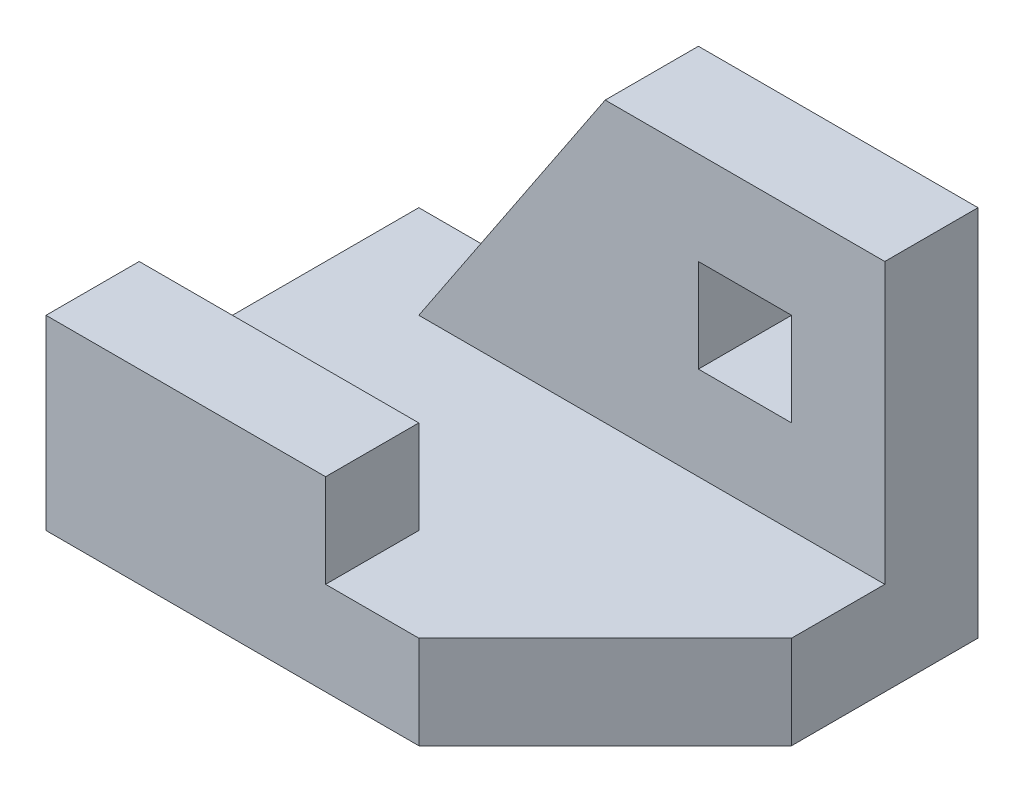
from build123d import *

# Parameters (mm, degrees)
SKETCH1_W      = 60
SKETCH1_H      = 40
EXTRUDE1_DEPTH = 10
CHAMFER1_SIZE  = 20
SKETCH2_W      = 30
SKETCH2_H      = 10
EXTRUDE2_DEPTH = 10
SKETCH3_W      = 10
SKETCH3_H      = 10
EXTRUDE3_DEPTH = 10


with BuildPart() as part:
    # Sketch1 → Extrude1 (new body)
    with BuildSketch(Plane(origin=(0, 0, 0), x_dir=(1, 0, 0), z_dir=(0, 1, 0))):
        Rectangle(SKETCH1_W, SKETCH1_H)
    extrude(amount=EXTRUDE1_DEPTH)

    # Chamfer1
    chamfer1_edges = [part.edges().sort_by_distance(p)[0] for p in [
        (30, 5, 20),
    ]]
    chamfer(chamfer1_edges, length=CHAMFER1_SIZE)

    # Sketch2 → Extrude2 (add)
    with BuildSketch(Plane(origin=(0, 10, 0), x_dir=(1, 0, 0), z_dir=(0, 1, 0))):
        with Locations((-15, -15)):
            Rectangle(SKETCH2_W, SKETCH2_H)
    extrude(amount=EXTRUDE2_DEPTH)

    # Sketch3 → Extrude3 (add)
    with BuildSketch(Plane(origin=(0, 0, -20), x_dir=(-1, 0, 0), z_dir=(0, 0, -1))):
        Polygon((-30, 10), (-30, 40), (0, 40), (20, 10), align=None)
        with Locations((-15, 25)):
            Rectangle(SKETCH3_W, SKETCH3_H, mode=Mode.SUBTRACT)
    extrude(amount=-EXTRUDE3_DEPTH)


solid = part.part
